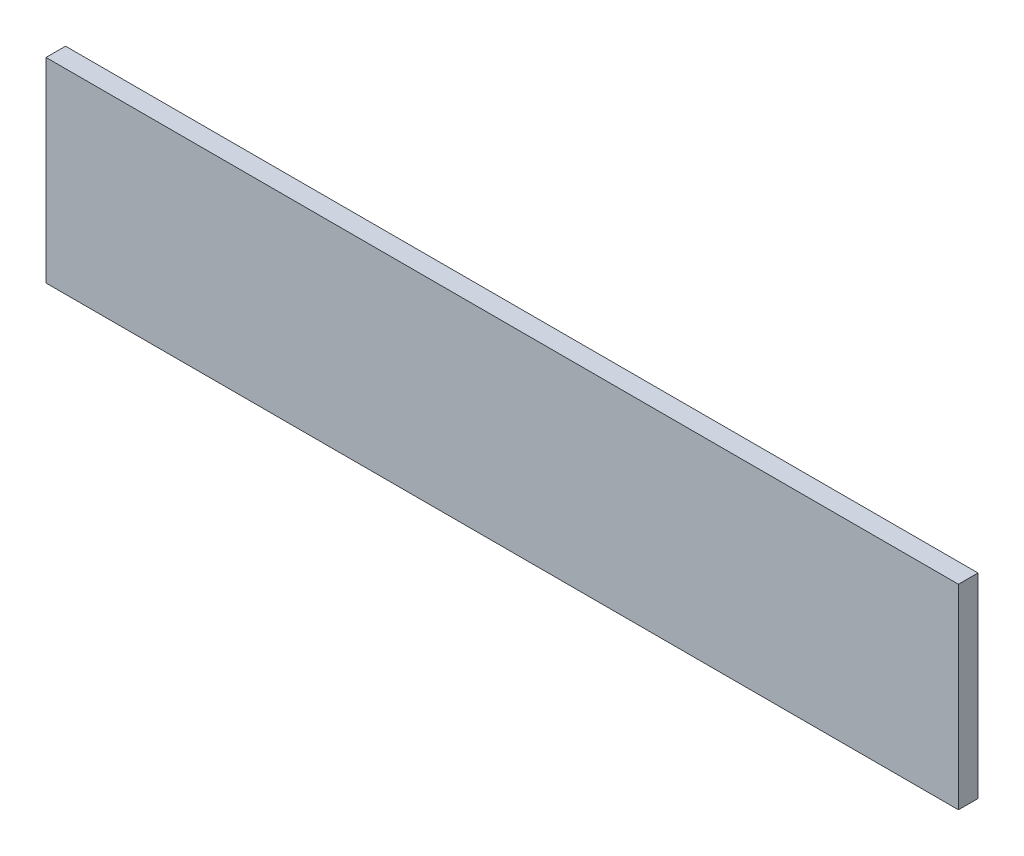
from build123d import *

# Parameters (mm, degrees)
SKETCH2_W           = 467
SKETCH2_H           = 100
BOSS_EXTRUDE1_DEPTH = 10


with BuildPart() as part:
    # Sketch2 → Boss-Extrude1 (new body)
    with BuildSketch(Plane.XY):
        Rectangle(SKETCH2_W, SKETCH2_H)
    extrude(amount=BOSS_EXTRUDE1_DEPTH)


solid = part.part
